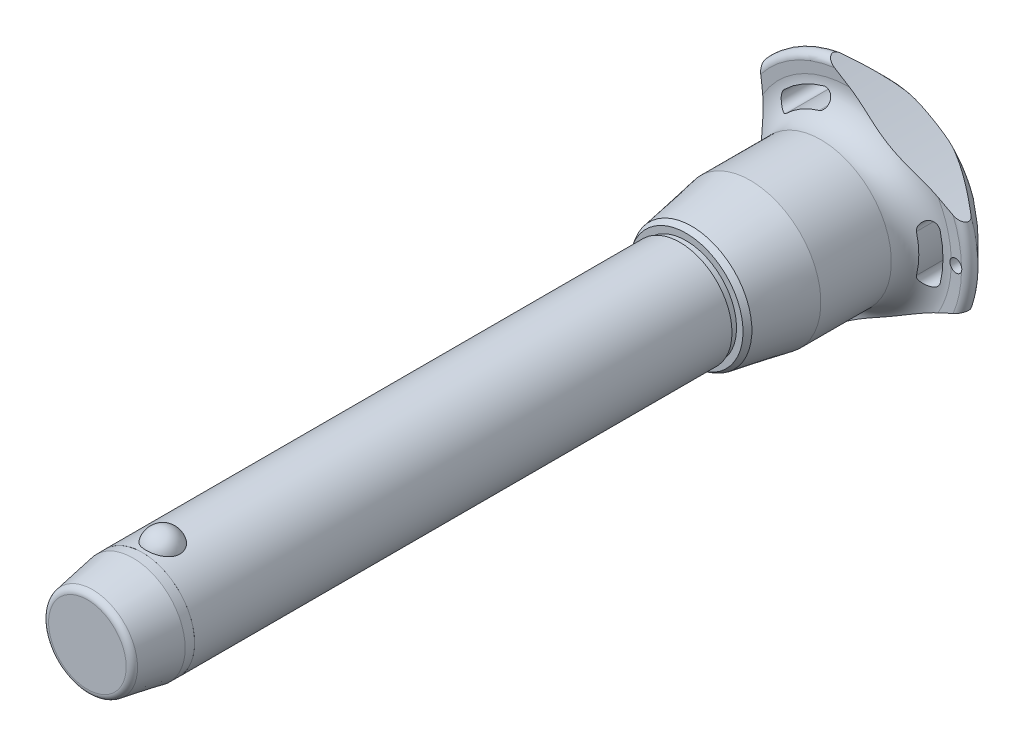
from build123d import *

# Parameters (mm, degrees)
SKETCH1_R           = 12.5
BOSS_EXTRUDE1_DEPTH = 120
SKETCH2_R           = 10
BOSS_EXTRUDE2_DEPTH = 50.7
BOSS_EXTRUDE3_START = 22
SKETCH1_2_R         = 12.5
BOSS_EXTRUDE3_DEPTH = 22
CHAMFER1_SIZE       = 11
CHAMFER1_SIZE2      = 1.939596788
FILLET1_R           = 1.5
SKETCH6_R           = 176.92625
CUT_EXTRUDE1_DEPTH  = 176.410549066
CIRPATTERN1_COUNT   = 3
SKETCH7_R           = 1.5
CUT_EXTRUDE2_DEPTH  = 176.323744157
SKETCH8_R           = 12.5
SKETCH8_R_2         = 12.49
CUT_EXTRUDE3_DEPTH  = 13.2


with BuildPart() as part:
    # Sketch1 → Boss-Extrude1 (new body)
    with BuildSketch(Plane.XY):
        Circle(SKETCH1_R)
    extrude(amount=-BOSS_EXTRUDE1_DEPTH)

    # Sketch2 → Boss-Extrude2 (add)
    with BuildSketch(Plane(origin=(0, 0, -120), x_dir=(-1, 0, 0), z_dir=(0, 0, -1))):
        with Locations(Location((0, 0, 0), (0, 0, 180))):
            Circle(SKETCH2_R)
    extrude(amount=BOSS_EXTRUDE2_DEPTH)

    # Sketch3 → Revolve1 (revolve)
    with BuildSketch(Plane(origin=(0, 0, 0), x_dir=(0, 0, -1), z_dir=(1, 0, 0))):
        with BuildLine():
            Line((-3.957271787, 15.4), (-3.957271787, 7.1))
            ThreePointArc((-3.957271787, 7.1), (0.192728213, 11.25), (-3.957271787, 15.4))
        make_face()
        with BuildLine():
            Line((-3.957271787, -7.1), (-3.957271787, -15.4))
            ThreePointArc((-3.957271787, -15.4), (0.192728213, -11.25), (-3.957271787, -7.1))
        make_face()
    revolve(axis=Axis((0, -7.1, 3.957271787), (0, 1, 0)))

    # Sketch1_2 → Boss-Extrude3 (add)
    with BuildSketch(Plane.XY.offset(BOSS_EXTRUDE3_START)):
        Circle(SKETCH1_2_R)
    extrude(amount=-BOSS_EXTRUDE3_DEPTH)

    # Chamfer1
    chamfer1_edges = [part.edges().sort_by_distance(p)[0] for p in [
        (-12.5, 0, 22),
    ]]
    chamfer1_side = [part.faces().sort_by_distance(p)[0] for p in [
        (-12.5, 0, -49),
    ]]
    chamfer(chamfer1_edges, length=CHAMFER1_SIZE, length2=CHAMFER1_SIZE2, reference=chamfer1_side[0])

    # Fillet1
    fillet1_edges = [part.edges().sort_by_distance(p)[0] for p in [
        (-10.560403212, 0, 22),
        (-10, 0, -170.7),
    ]]
    fillet(fillet1_edges, radius=FILLET1_R)

    # Sketch4 → Revolve2 (revolve)
    with BuildSketch(Plane(origin=(0, 0, 0), x_dir=(0, 0, -1), z_dir=(1, 0, 0)), mode=Mode.PRIVATE) as revolve2_sk:
        Polygon((120, 0), (120, 12.089202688), (121.5, 12.089202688), (121.5, 13.644437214), (122.846872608, 14.422054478), (136.9, 16.9), (153.8, 16.9), (153.8, 0), align=None)
    revolve(revolve2_sk.sketch.rotate(Axis((0, 0, -153.8), (0, 0, 1)), 90), axis=Axis((0, 0, -153.8), (0, 0, 1)))

    # Sketch5 → Revolve3 (revolve)
    with BuildSketch(Plane(origin=(0, 0, 0), x_dir=(0, 0, -1), z_dir=(1, 0, 0)), mode=Mode.PRIVATE) as revolve3_sk:
        with BuildLine():
            Line((160.790129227, 24.271609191), (160.652256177, 26.865060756))
            ThreePointArc((160.652256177, 26.865060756), (161.598671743, 28.411427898), (163.38137085, 28.08137085))
            Line((163.38137085, 28.08137085), (169.763226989, 21.69951471))
            ThreePointArc((169.763226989, 21.69951471), (170.7, 19.381044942), (169.683055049, 17.096604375))
            ThreePointArc((169.683055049, 17.096604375), (164.18864484, 9.321268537), (162.25, 0))
            Line((162.25, 0), (153.8, 0))
            Line((153.8, 0), (153.8, 16.9))
            ThreePointArc((153.8, 16.9), (158.879432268, 19.083427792), (160.790129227, 24.271609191))
        make_face()
    revolve(revolve3_sk.sketch.rotate(Axis((0, 0, -162.25), (0, 0, 1)), 90), axis=Axis((0, 0, -162.25), (0, 0, 1)))

    # Sketch6 → Cut-Extrude1 (cut, through all)
    with BuildSketch(Plane.XY):
        with Locations((-197.42625, 0)):
            Circle(SKETCH6_R)
        with BuildLine():
            ThreePointArc((21.757076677, -5.447614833), (22.428706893, 0), (21.757076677, 5.447614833))
            ThreePointArc((21.757076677, 5.447614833), (19.521745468, 6.787716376), (18.181643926, 4.552385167))
            ThreePointArc((18.181643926, 4.552385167), (18.742902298, 0), (18.181643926, -4.552385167))
            ThreePointArc((18.181643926, -4.552385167), (19.521745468, -6.787716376), (21.757076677, -5.447614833))
        make_face()
    cut_extrude1 = extrude(amount=-CUT_EXTRUDE1_DEPTH, mode=Mode.SUBTRACT)

    # CirPattern1: Cut-Extrude1 ×3 about axis
    cirpattern1_axis = Axis((0, 0, 0), (0, 0, 1))
    for i in range(1, CIRPATTERN1_COUNT):
        add(cut_extrude1.rotate(cirpattern1_axis, i * 360 / CIRPATTERN1_COUNT), mode=Mode.SUBTRACT)

    # Sketch7 → Cut-Extrude2 (cut, through all)
    with BuildSketch(Plane.XY):
        with Locations(Location((25.428706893, 0, 0), (0, 0, 17.230769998))):
            Circle(SKETCH7_R)
    extrude(amount=-CUT_EXTRUDE2_DEPTH, mode=Mode.SUBTRACT)

    # Sketch8 → Cut-Extrude3 (cut)
    with BuildSketch(Plane.XY.offset(22)):
        Circle(SKETCH8_R)
        Circle(SKETCH8_R_2, mode=Mode.SUBTRACT)
    extrude(amount=-CUT_EXTRUDE3_DEPTH, mode=Mode.SUBTRACT)


solid = part.part
